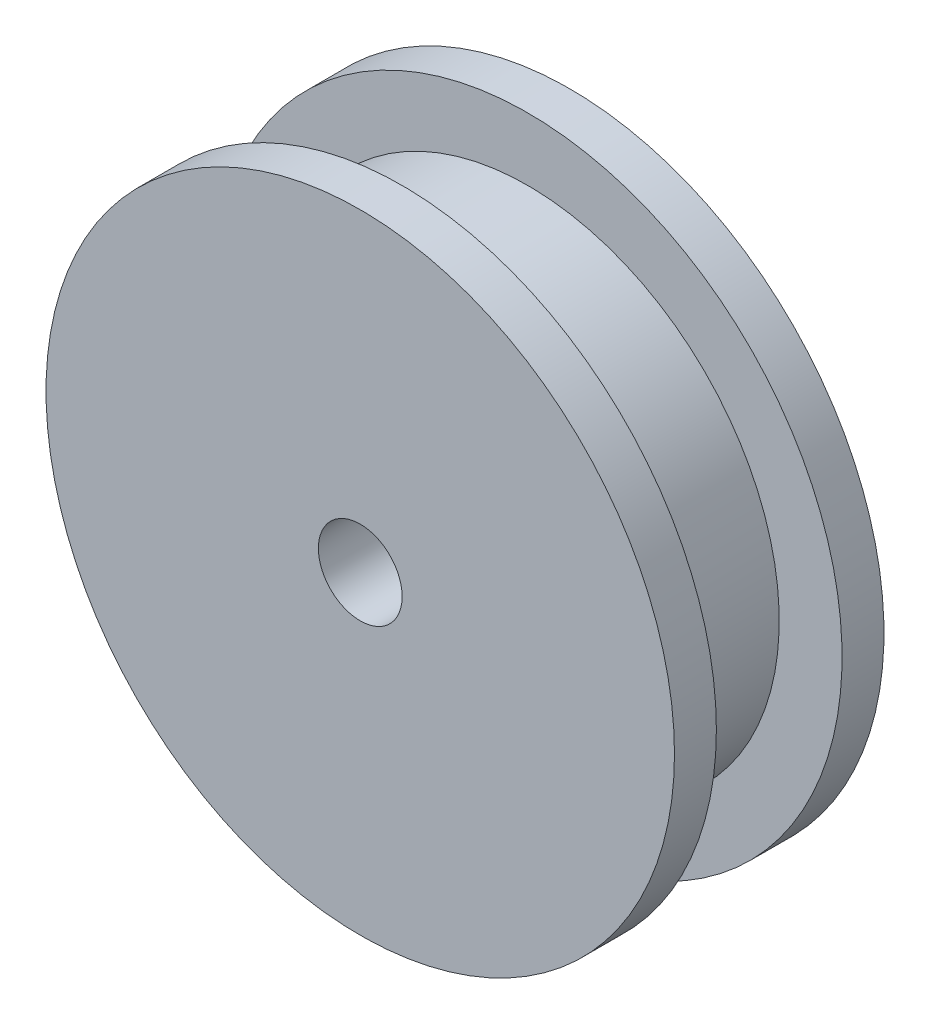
from build123d import *

# Parameters (mm, degrees)
SKETCH1_R          = 76.2
EXTRUDE1_DEPTH     = 19.05
SKETCH2_R          = 95.25
EXTRUDE2_DEPTH     = 12.7
EXTRUDE3_START     = 12.7
SKETCH3_R          = 95.25
EXTRUDE3_DEPTH     = 12.7
SKETCH4_R          = 12.7
CUT_EXTRUDE1_DEPTH = 149.920700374


with BuildPart() as part:
    # Sketch1 → Extrude1 (new, symmetric)
    with BuildSketch(Plane.XY):
        with Locations(Location((0, 0, 0), (0, 0, 180))):
            Circle(SKETCH1_R)
    extrude(amount=EXTRUDE1_DEPTH, both=True)

    # Sketch2 → Extrude2 (add)
    with BuildSketch(Plane.XY.offset(19.05)):
        Circle(SKETCH2_R)
    extrude(amount=EXTRUDE2_DEPTH)

    # Sketch3 → Extrude3 (add)
    with BuildSketch(Plane(origin=(0, 0, -19.05), x_dir=(-1, 0, 0), z_dir=(0, 0, -1)).offset(EXTRUDE3_START)):
        with Locations(Location((0, 0, 0), (0, 0, 180))):
            Circle(SKETCH3_R)
    extrude(amount=-EXTRUDE3_DEPTH)

    # Sketch4 → Cut-Extrude1 (cut, through all)
    with BuildSketch(Plane.XY.offset(31.75)):
        Circle(SKETCH4_R)
    extrude(amount=-CUT_EXTRUDE1_DEPTH, mode=Mode.SUBTRACT)


solid = part.part
